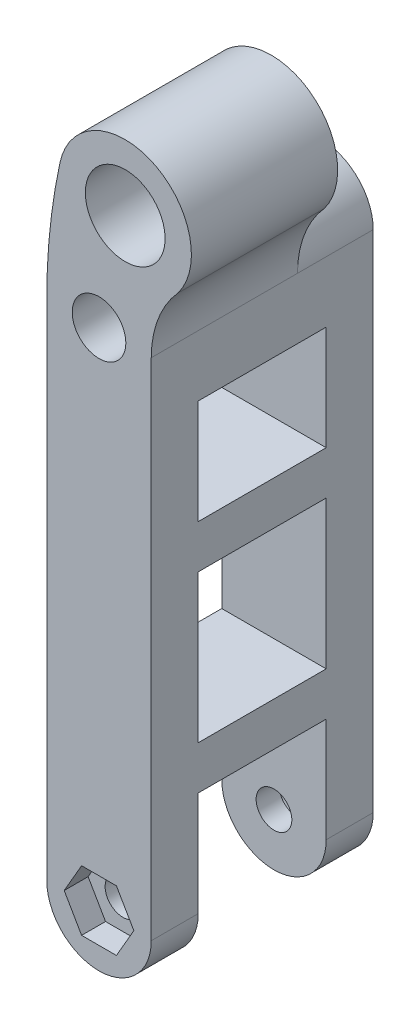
from build123d import *

# Parameters (mm, degrees)
SKETCH_1_R           = 3.08
SKETCH_1_R_2         = 2.05
EXTRUDE_7_DEPTH      = 25.5
SKETCH_6_W           = 14.7
SKETCH_6_H           = 18
SKETCH_6_H_2         = 17
SKETCH_6_H_3         = 12
CUT_EXTRUDE_1_DEPTH  = 20
EXTRUDE_8_DEPTH      = 4.05
EXTRUDE_8_DEPTH_BACK = 12.75
SKETCH_8_R           = 4.58
CUT_EXTRUDE_2_DEPTH  = 2.75
SKETCH_10_R          = 4
CUT_EXTRUDE_3_DEPTH  = 2.75


with BuildPart() as part:
    # Sketch 1 → Extrude 7 (new body)
    with BuildSketch(Plane.XY):
        with BuildLine():
            Line((0, 0), (0, 58))
            ThreePointArc((0, 58), (6, 64), (12, 58))
            Line((12, 58), (12, 0))
            ThreePointArc((12, 0), (6, -6), (0, 0))
        make_face()
        with Locations((6, 58)):
            Circle(SKETCH_1_R, mode=Mode.SUBTRACT)
        with Locations((6, 0)):
            Circle(SKETCH_1_R_2, mode=Mode.SUBTRACT)
    extrude(amount=-EXTRUDE_7_DEPTH)

    # Sketch 6 → Cut-Extrude 1 (cut)
    with BuildSketch(Plane(origin=(12, 0, 0), x_dir=(0, 0, -1), z_dir=(1, 0, 0))):
        with Locations((12.75, 3)):
            Rectangle(SKETCH_6_W, SKETCH_6_H)
        with Locations((12.75, 25.5)):
            Rectangle(SKETCH_6_W, SKETCH_6_H_2)
        with Locations((12.75, 45)):
            Rectangle(SKETCH_6_W, SKETCH_6_H_3)
    extrude(amount=-CUT_EXTRUDE_1_DEPTH, mode=Mode.SUBTRACT)

    # Sketch 8 → Extrude 8 (add, two sides: drawn at the far end of the back side and taken through both)
    with BuildSketch(Plane(origin=(0, 0, -12.75), x_dir=(-1, 0, 0), z_dir=(0, 0, -1)).offset(-EXTRUDE_8_DEPTH_BACK)):
        with BuildLine():
            Line((-12, 58), (-12, 56.499795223))
            Line((-12, 56.499795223), (-8.237778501, 61.53127993))
            Line((-8.237778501, 61.53127993), (-2.748886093, 61.53127993))
            Line((-2.748886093, 61.53127993), (0, 56.042387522))
            Line((0, 56.042387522), (0, 58))
            ThreePointArc((0, 58), (-0.381285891, 65.137203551), (-1.520803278, 72.193162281))
            ThreePointArc((-1.520803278, 72.193162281), (-12.151968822, 77.519203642), (-15.087770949, 65.996640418))
            ThreePointArc((-15.087770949, 65.996640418), (-12.798752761, 62.28604093), (-12, 58))
        make_face()
        with Locations((-9.012708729, 70.64595424)):
            Circle(SKETCH_8_R, mode=Mode.SUBTRACT)
    extrude(amount=EXTRUDE_8_DEPTH + EXTRUDE_8_DEPTH_BACK)

    # Sketch 9 → Cut-Extrude 2 (cut)
    with BuildSketch(Plane.XY):
        Polygon((10, 0), (8, 3.464101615), (4, 3.464101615), (2, 0), (4, -3.464101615), (8, -3.464101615), align=None)
    extrude(amount=-CUT_EXTRUDE_2_DEPTH, mode=Mode.SUBTRACT)

    # Sketch 10 → Cut-Extrude 3 (cut)
    with BuildSketch(Plane(origin=(0, 0, -25.5), x_dir=(-1, 0, 0), z_dir=(0, 0, -1))):
        with Locations((-6, 0)):
            Circle(SKETCH_10_R)
    extrude(amount=-CUT_EXTRUDE_3_DEPTH, mode=Mode.SUBTRACT)


solid = part.part
